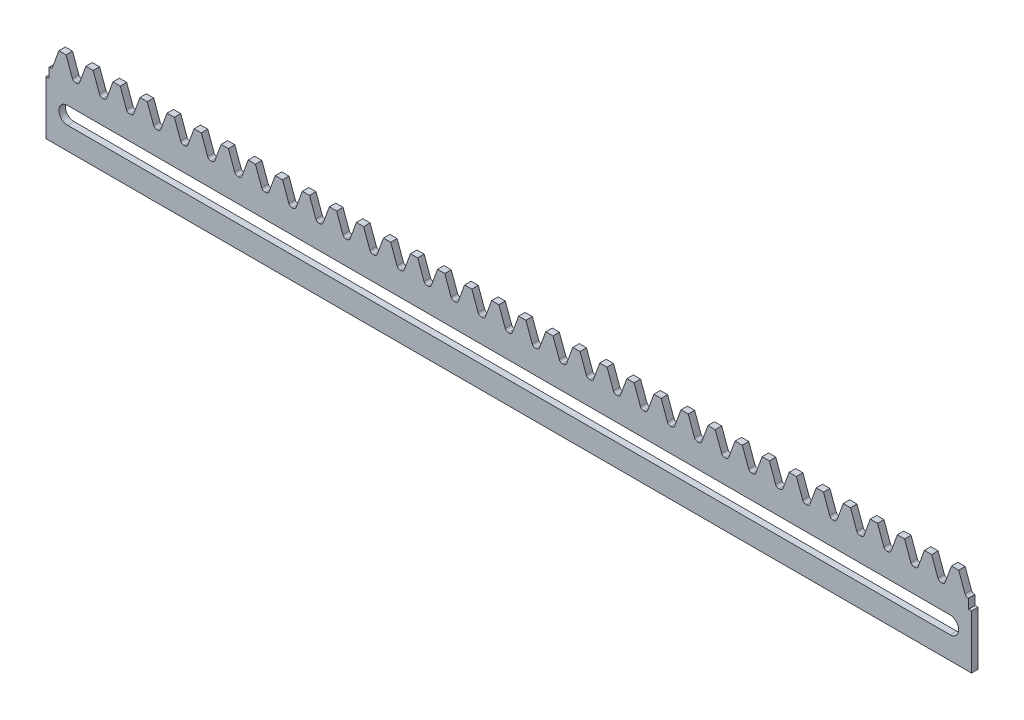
from build123d import *

# Parameters (mm, degrees)
SECTION_CREMAILLERE_W      = 3
SECTION_CREMAILLERE_H      = 16.56159266
BASE_EXTRUSION_DEPTH       = 427.25660176
ENL_V_START                = -425.222261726
ENL_V_MAT_EXTRU_2_DEPTH    = 525.222261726
R_P_TITION_LIN_AIRE1_COUNT = 34
R_P_TITION_LIN_AIRE1_PITCH = 12.56637064
ESQUISSE3_W                = 430
ESQUISSE3_H                = 25
BOSS_EXTRU_1_DEPTH         = 3


with BuildPart() as part:
    # Section Cremaillere → Base-Extrusion (new body)
    with BuildSketch(Plane(origin=(-3.14159266, 0, 0), x_dir=(0, 0, -1), z_dir=(1, 0, 0))):
        with Locations((0, -1.13920367)):
            Rectangle(SECTION_CREMAILLERE_W, SECTION_CREMAILLERE_H)
    extrude(amount=BASE_EXTRUSION_DEPTH)

    # Esquisse1 → Enl_v. mat.-Extru.2 (cut)
    with BuildSketch(Plane.XY.offset(ENL_V_START)):
        with BuildLine():
            Line((1.455582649, 4), (-1.45550134, -3.99977656))
            ThreePointArc((-1.45550134, -3.99977656), (-2.011991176, -4.725082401), (-2.883868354, -5))
            Line((-2.883868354, -5), (-3.14159266, -5))
            Line((-3.14159266, -5), (-3.14159266, 7.14159266))
            Line((-3.14159266, 7.14159266), (9.42477798, 7.14159266))
            Line((9.42477798, 7.14159266), (9.42477798, -5))
            Line((9.42477798, -5), (9.167053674, -5))
            ThreePointArc((9.167053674, -5), (8.295176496, -4.725082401), (7.73868666, -3.99977656))
            Line((7.73868666, -3.99977656), (4.827602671, 4))
            Line((4.827602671, 4), (1.455582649, 4))
        make_face()
    enl_v_mat_extru_2 = extrude(amount=ENL_V_MAT_EXTRU_2_DEPTH, mode=Mode.SUBTRACT)

    # R_p_tition lin_aire1: Enl_v. mat.-Extru.2 ×34
    with Locations(*[(i * R_P_TITION_LIN_AIRE1_PITCH, 0, 0) for i in range(1, R_P_TITION_LIN_AIRE1_COUNT)]):
        add(enl_v_mat_extru_2, mode=Mode.SUBTRACT)

    # Esquisse3 → Boss.-Extru.1 (add, through all)
    with BuildSketch(Plane.XY.offset(1.5)):
        with Locations((210.48670822, -21.92)):
            Rectangle(ESQUISSE3_W, ESQUISSE3_H)
        with BuildLine():
            Line((5.48670822, -16), (415.48670822, -16))
            ThreePointArc((415.48670822, -16), (419.48670822, -20), (415.48670822, -24))
            Line((415.48670822, -24), (5.48670822, -24))
            ThreePointArc((5.48670822, -24), (1.48670822, -20), (5.48670822, -16))
        make_face(mode=Mode.SUBTRACT)
    extrude(amount=-BOSS_EXTRU_1_DEPTH)


solid = part.part
